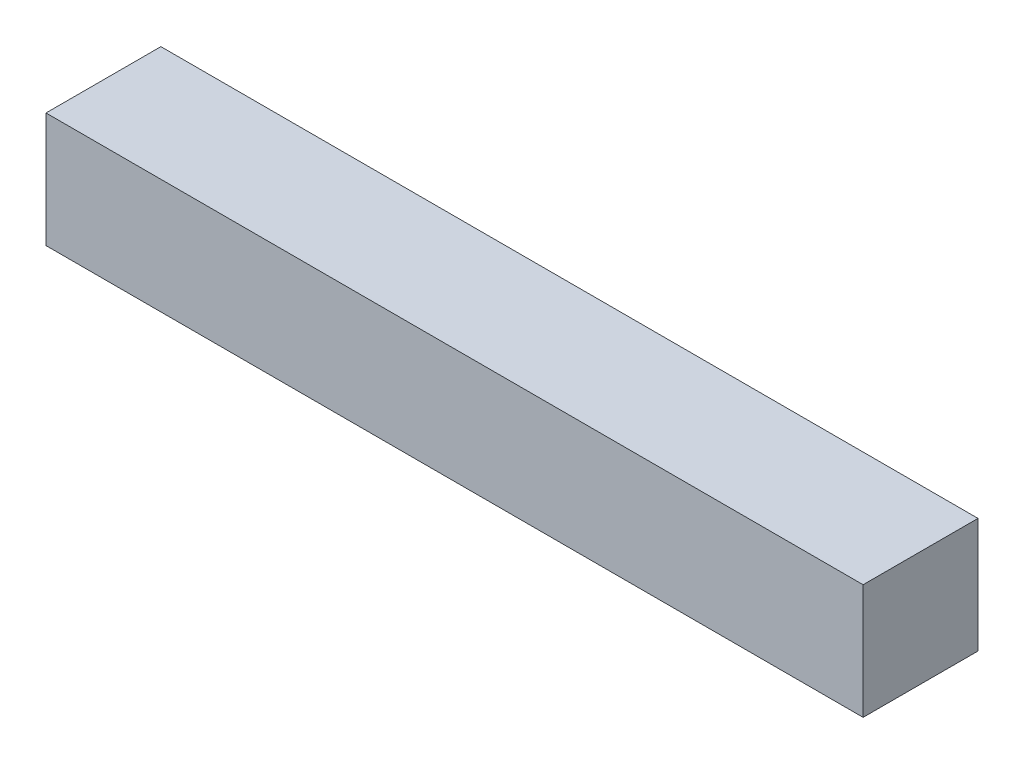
from build123d import *

# Parameters (mm, degrees)
SKETCH1_W          = 177.8
SKETCH1_H          = 25
BASE_EXTRUDE_DEPTH = 25


with BuildPart() as part:
    # Sketch1 → Base-Extrude (new body)
    with BuildSketch(Plane.XY):
        with Locations((-101.6, 203)):
            Rectangle(SKETCH1_W, SKETCH1_H)
    extrude(amount=BASE_EXTRUDE_DEPTH)


solid = part.part
